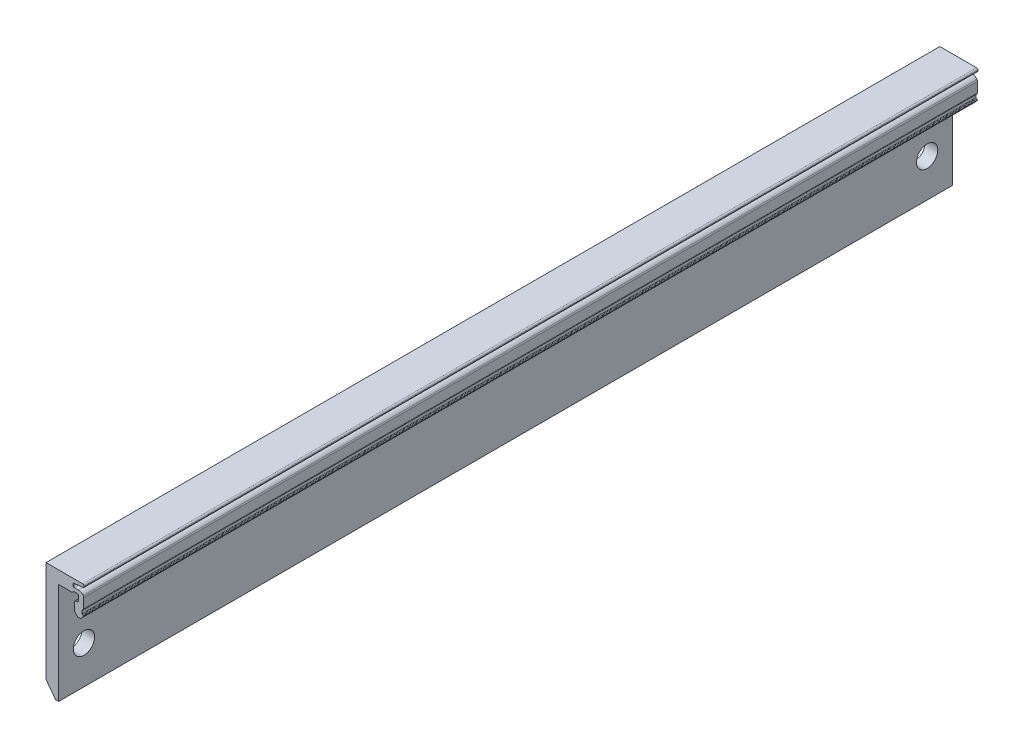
from build123d import *

# Parameters (mm, degrees)
EXTRUDE_1_DEPTH     = 88.225
SKETCH_3_R          = 2.1
CUT_EXTRUDE_2_DEPTH = 3314.78699353


with BuildPart() as part:
    # Sketch 1 → Extrude 1 (new, symmetric)
    with BuildSketch(Plane.XY):
        with BuildLine():
            Line((2350.384035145, -3290.103769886), (2355.384035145, -3290.103769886))
            Line((2355.384035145, -3290.103769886), (2357.624035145, -3290.103769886))
            ThreePointArc((2357.624035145, -3290.103769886), (2357.836167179, -3290.191637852), (2357.924035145, -3290.403769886))
            Line((2357.924035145, -3290.403769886), (2357.924035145, -3290.492459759))
            ThreePointArc((2357.924035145, -3290.492459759), (2357.87266411, -3290.626285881), (2357.744940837, -3290.691364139))
            Line((2357.744940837, -3290.691364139), (2355.903129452, -3290.884946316))
            ThreePointArc((2355.903129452, -3290.884946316), (2355.775406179, -3290.950024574), (2355.724035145, -3291.083850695))
            Line((2355.724035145, -3291.083850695), (2355.724035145, -3291.403769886))
            ThreePointArc((2355.724035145, -3291.403769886), (2355.782613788, -3291.545191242), (2355.924035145, -3291.603769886))
            Line((2355.924035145, -3291.603769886), (2356.769984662, -3291.603769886))
            ThreePointArc((2356.769984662, -3291.603769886), (2357.299096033, -3291.726717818), (2357.719785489, -3292.070367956))
            ThreePointArc((2357.719785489, -3292.070367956), (2357.797255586, -3292.214513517), (2357.824035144, -3292.375952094))
            Line((2357.824035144, -3292.375952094), (2357.824035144, -3294.273769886))
            ThreePointArc((2357.824035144, -3294.273769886), (2357.779946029, -3294.430325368), (2357.660637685, -3294.540864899))
            ThreePointArc((2357.660637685, -3294.540864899), (2357.54132934, -3294.65140443), (2357.497240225, -3294.807959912))
            Line((2357.497240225, -3294.807959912), (2357.497240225, -3295.307959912))
            ThreePointArc((2357.497240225, -3295.307959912), (2357.526529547, -3295.37867059), (2357.597240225, -3295.407959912))
            Line((2357.597240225, -3295.407959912), (2357.724035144, -3295.407959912))
            ThreePointArc((2357.724035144, -3295.407959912), (2357.794745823, -3295.437249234), (2357.824035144, -3295.507959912))
            Line((2357.824035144, -3295.507959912), (2357.824035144, -3295.527361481))
            ThreePointArc((2357.824035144, -3295.527361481), (2357.818000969, -3295.561572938), (2357.800626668, -3295.591655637))
            Line((2357.800626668, -3295.591655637), (2357.383057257, -3296.089092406))
            ThreePointArc((2357.383057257, -3296.089092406), (2356.924035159, -3296.303081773), (2356.465013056, -3296.089092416))
            Line((2356.465013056, -3296.089092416), (2356.094260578, -3295.647427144))
            ThreePointArc((2356.094260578, -3295.647427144), (2356.042137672, -3295.557179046), (2356.024035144, -3295.454544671))
            Line((2356.024035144, -3295.454544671), (2356.024035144, -3294.003769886))
            ThreePointArc((2356.024035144, -3294.003769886), (2356.11190311, -3293.791637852), (2356.324035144, -3293.703769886))
            Line((2356.324035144, -3293.703769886), (2356.524035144, -3293.703769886))
            ThreePointArc((2356.524035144, -3293.703769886), (2356.736167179, -3293.61590192), (2356.824035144, -3293.403769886))
            Line((2356.824035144, -3293.403769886), (2356.824035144, -3292.603769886))
            ThreePointArc((2356.824035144, -3292.603769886), (2356.736167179, -3292.391637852), (2356.524035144, -3292.303769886))
            Line((2356.524035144, -3292.303769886), (2355.987964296, -3292.303769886))
            ThreePointArc((2355.987964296, -3292.303769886), (2355.837964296, -3292.343962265), (2355.728156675, -3292.453769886))
            ThreePointArc((2355.728156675, -3292.453769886), (2355.618349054, -3292.563577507), (2355.468349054, -3292.603769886))
            Line((2355.468349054, -3292.603769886), (2355.384035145, -3292.603769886))
            Line((2355.384035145, -3292.603769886), (2352.884035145, -3292.603769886))
            Line((2352.884035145, -3292.603769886), (2352.884035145, -3312.603769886))
            Line((2352.884035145, -3312.603769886), (2352.284035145, -3312.603769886))
            Line((2352.284035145, -3312.603769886), (2350.384035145, -3310.103769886))
            Line((2350.384035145, -3310.103769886), (2350.384035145, -3292.603769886))
            Line((2350.384035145, -3292.603769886), (2350.384035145, -3290.103769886))
        make_face()
    extrude(amount=EXTRUDE_1_DEPTH, both=True)

    # Sketch 3 → Cut-Extrude 2 (cut, through all)
    with BuildSketch(Plane.ZY.offset(-2350.384035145)):
        with Locations(Location((-83.225, -3305.103769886, 0), (0, 0, 270))):
            Circle(SKETCH_3_R)
        with Locations(Location((83.225, -3305.103769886, 0), (0, 0, 270))):
            Circle(SKETCH_3_R)
    extrude(amount=-CUT_EXTRUDE_2_DEPTH, mode=Mode.SUBTRACT)


solid = part.part
